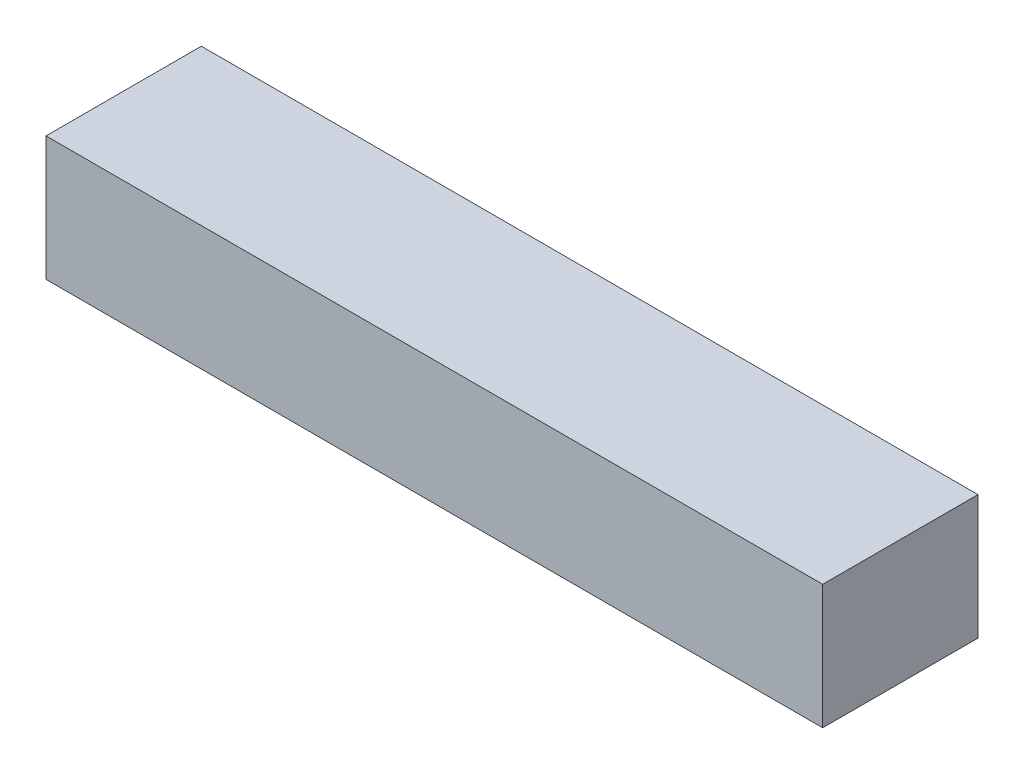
from build123d import *

# Parameters (mm, degrees)
SKETCH1_W           = 50
SKETCH1_H           = 8
BOSS_EXTRUDE1_DEPTH = 10


with BuildPart() as part:
    # Sketch1 → Boss-Extrude1 (new body)
    with BuildSketch(Plane.XY):
        Rectangle(SKETCH1_W, SKETCH1_H)
    extrude(amount=BOSS_EXTRUDE1_DEPTH)


solid = part.part
